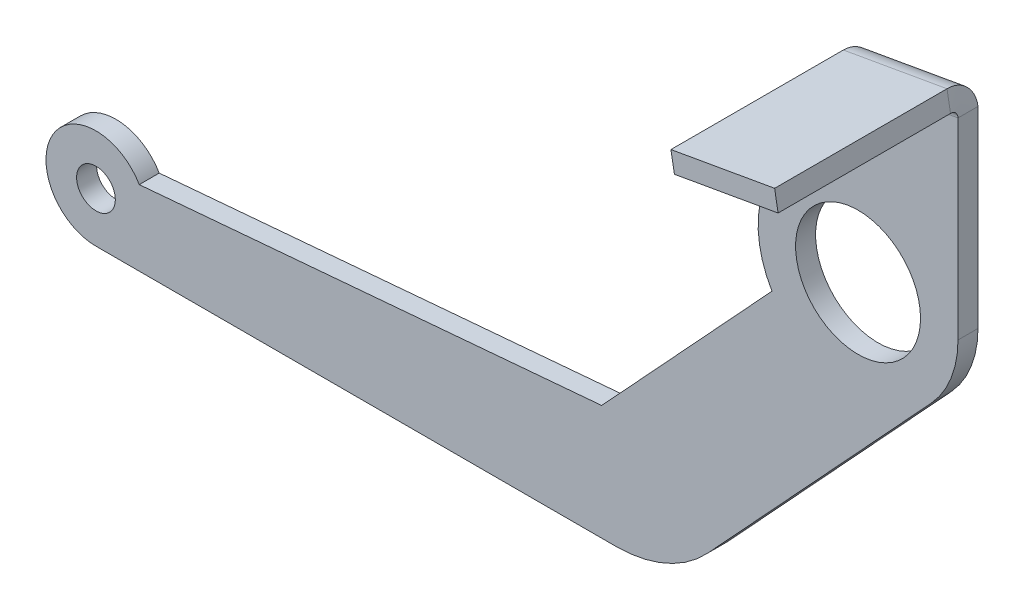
ISO-10303-21;
HEADER;
FILE_DESCRIPTION(('STEP AP214'),'2;1');
FILE_NAME('part.step','',(''),(''),'','','');
FILE_SCHEMA(('AUTOMOTIVE_DESIGN { 1 0 10303 214 1 1 1 1 }'));
ENDSEC;
DATA;
#1=APPLICATION_CONTEXT('core data for automotive mechanical design processes');
#2=APPLICATION_PROTOCOL_DEFINITION('international standard','automotive_design',2000,#1);
#3=PRODUCT_CONTEXT('',#1,'mechanical');
#4=PRODUCT('Part','Part','',(#3));
#5=PRODUCT_RELATED_PRODUCT_CATEGORY('part','',(#4));
#6=PRODUCT_DEFINITION_FORMATION('','',#4);
#7=PRODUCT_DEFINITION_CONTEXT('part definition',#1,'design');
#8=PRODUCT_DEFINITION('design','',#6,#7);
#9=PRODUCT_DEFINITION_SHAPE('','',#8);
#10=(LENGTH_UNIT() NAMED_UNIT(*) SI_UNIT(.MILLI.,.METRE.));
#11=(NAMED_UNIT(*) PLANE_ANGLE_UNIT() SI_UNIT($,.RADIAN.));
#12=(NAMED_UNIT(*) SI_UNIT($,.STERADIAN.) SOLID_ANGLE_UNIT());
#13=UNCERTAINTY_MEASURE_WITH_UNIT(LENGTH_MEASURE(1.E-05),#10,'distance_accuracy_value','');
#14=(GEOMETRIC_REPRESENTATION_CONTEXT(3) GLOBAL_UNCERTAINTY_ASSIGNED_CONTEXT((#13)) GLOBAL_UNIT_ASSIGNED_CONTEXT((#10,
#11,#12)) REPRESENTATION_CONTEXT('',''));
#15=CARTESIAN_POINT('',(0.,0.,0.));
#16=DIRECTION('',(0.,0.,1.));
#17=DIRECTION('',(1.,0.,0.));
#18=AXIS2_PLACEMENT_3D('',#15,#16,#17);
#19=CARTESIAN_POINT('',(60.7,0.,1.6));
#20=DIRECTION('',(1.,0.,0.));
#21=DIRECTION('',(0.,1.,0.));
#22=AXIS2_PLACEMENT_3D('',#19,#20,#21);
#23=PLANE('',#22);
#24=DIRECTION('',(0.,1.,0.));
#25=VECTOR('',#24,1.);
#26=CARTESIAN_POINT('',(60.7,0.,1.6));
#27=LINE('',#26,#25);
#28=CARTESIAN_POINT('',(60.7,31.9943730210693,1.6));
#29=VERTEX_POINT('',#28);
#30=CARTESIAN_POINT('',(60.7,37.1148888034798,1.6));
#31=VERTEX_POINT('',#30);
#32=EDGE_CURVE('E363',#29,#31,#27,.T.);
#33=ORIENTED_EDGE('',*,*,#32,.T.);
#34=DIRECTION('',(0.,0.,1.));
#35=VECTOR('',#34,1.);
#36=CARTESIAN_POINT('',(60.7,37.1148888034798,1.60000000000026));
#37=LINE('',#36,#35);
#38=CARTESIAN_POINT('',(60.7,37.1148888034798,0.));
#39=VERTEX_POINT('',#38);
#40=EDGE_CURVE('E408',#31,#39,#37,.F.);
#41=ORIENTED_EDGE('',*,*,#40,.T.);
#42=DIRECTION('',(0.,1.,0.));
#43=VECTOR('',#42,1.);
#44=CARTESIAN_POINT('',(60.7,0.,0.));
#45=LINE('',#44,#43);
#46=CARTESIAN_POINT('',(60.7,31.9943730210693,0.));
#47=VERTEX_POINT('',#46);
#48=EDGE_CURVE('E374',#47,#39,#45,.T.);
#49=ORIENTED_EDGE('',*,*,#48,.F.);
#50=DIRECTION('',(0.,0.,1.));
#51=VECTOR('',#50,1.);
#52=CARTESIAN_POINT('',(60.7,31.9943730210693,1.6));
#53=LINE('',#52,#51);
#54=EDGE_CURVE('E323',#47,#29,#53,.T.);
#55=ORIENTED_EDGE('',*,*,#54,.T.);
#56=EDGE_LOOP('',(#33,#41,#49,#55));
#57=FACE_BOUND('',#56,.T.);
#58=ADVANCED_FACE('F39',(#57),#23,.F.);
#59=CARTESIAN_POINT('',(0.,0.,1.6));
#60=DIRECTION('',(0.,0.,1.));
#61=DIRECTION('',(1.,0.,0.));
#62=AXIS2_PLACEMENT_3D('',#59,#60,#61);
#63=PLANE('',#62);
#64=CARTESIAN_POINT('',(61.,24.,1.6));
#65=DIRECTION('',(0.,0.,1.));
#66=DIRECTION('',(1.,0.,0.));
#67=AXIS2_PLACEMENT_3D('',#64,#65,#66);
#68=CIRCLE('',#67,5.);
#69=CARTESIAN_POINT('',(66.,24.,1.6));
#70=VERTEX_POINT('',#69);
#71=EDGE_CURVE('E415',#70,#70,#68,.T.);
#72=ORIENTED_EDGE('',*,*,#71,.F.);
#73=EDGE_LOOP('',(#72));
#74=FACE_BOUND('',#73,.T.);
#75=CARTESIAN_POINT('',(0.,0.,1.6));
#76=DIRECTION('',(0.,0.,1.));
#77=DIRECTION('',(1.,0.,0.));
#78=AXIS2_PLACEMENT_3D('',#75,#76,#77);
#79=CIRCLE('',#78,1.55);
#80=CARTESIAN_POINT('',(1.55,0.,1.6));
#81=VERTEX_POINT('',#80);
#82=EDGE_CURVE('E419',#81,#81,#79,.T.);
#83=ORIENTED_EDGE('',*,*,#82,.F.);
#84=EDGE_LOOP('',(#83));
#85=FACE_BOUND('',#84,.T.);
#86=DIRECTION('',(1.,0.,0.));
#87=VECTOR('',#86,1.);
#88=CARTESIAN_POINT('',(0.,-4.00000000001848,1.6));
#89=LINE('',#88,#87);
#90=CARTESIAN_POINT('',(0.,-4.00000000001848,1.6));
#91=VERTEX_POINT('',#90);
#92=CARTESIAN_POINT('',(41.6275410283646,-4.00000000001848,1.6));
#93=VERTEX_POINT('',#92);
#94=EDGE_CURVE('E344',#91,#93,#89,.T.);
#95=ORIENTED_EDGE('',*,*,#94,.T.);
#96=CARTESIAN_POINT('',(41.6275410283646,5.99999999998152,1.6));
#97=DIRECTION('',(0.,0.,1.));
#98=DIRECTION('',(1.,0.,0.));
#99=AXIS2_PLACEMENT_3D('',#96,#97,#98);
#100=CIRCLE('',#99,10.);
#101=CARTESIAN_POINT('',(48.9689073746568,-0.790017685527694,1.6));
#102=VERTEX_POINT('',#101);
#103=EDGE_CURVE('E61',#93,#102,#100,.T.);
#104=ORIENTED_EDGE('',*,*,#103,.T.);
#105=DIRECTION('',(0.679001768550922,0.734136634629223,0.));
#106=VECTOR('',#105,1.);
#107=CARTESIAN_POINT('',(26.7859238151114,-24.7742569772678,1.6));
#108=LINE('',#107,#106);
#109=CARTESIAN_POINT('',(66.8730930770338,18.5679858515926,1.6));
#110=VERTEX_POINT('',#109);
#111=EDGE_CURVE('E349',#102,#110,#108,.T.);
#112=ORIENTED_EDGE('',*,*,#111,.T.);
#113=CARTESIAN_POINT('',(61.,24.,1.6));
#114=DIRECTION('',(0.,0.,1.));
#115=DIRECTION('',(1.,0.,0.));
#116=AXIS2_PLACEMENT_3D('',#113,#114,#115);
#117=CIRCLE('',#116,8.);
#118=CARTESIAN_POINT('',(69.,24.,1.6));
#119=VERTEX_POINT('',#118);
#120=EDGE_CURVE('E351',#110,#119,#117,.T.);
#121=ORIENTED_EDGE('',*,*,#120,.T.);
#122=DIRECTION('',(0.,1.,0.));
#123=VECTOR('',#122,1.);
#124=CARTESIAN_POINT('',(69.,0.,1.6));
#125=LINE('',#124,#123);
#126=CARTESIAN_POINT('',(69.,39.3907440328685,1.6));
#127=VERTEX_POINT('',#126);
#128=EDGE_CURVE('E359',#119,#127,#125,.T.);
#129=ORIENTED_EDGE('',*,*,#128,.T.);
#130=DIRECTION('',(-0.98480775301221,-0.173648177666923,0.));
#131=VECTOR('',#130,1.);
#132=CARTESIAN_POINT('',(60.8041889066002,37.9456014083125,1.59999999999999));
#133=LINE('',#132,#131);
#134=CARTESIAN_POINT('',(60.8041889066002,37.9456014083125,1.6));
#135=VERTEX_POINT('',#134);
#136=EDGE_CURVE('E208',#135,#127,#133,.F.);
#137=ORIENTED_EDGE('',*,*,#136,.F.);
#138=DIRECTION('',(-0.173648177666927,0.984807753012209,0.));
#139=VECTOR('',#138,1.);
#140=CARTESIAN_POINT('',(60.9431074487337,37.1577552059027,1.59999999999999));
#141=LINE('',#140,#139);
#142=CARTESIAN_POINT('',(60.9431074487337,37.1577552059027,1.6));
#143=VERTEX_POINT('',#142);
#144=EDGE_CURVE('E409',#143,#135,#141,.T.);
#145=ORIENTED_EDGE('',*,*,#144,.F.);
#146=DIRECTION('',(0.984807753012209,0.173648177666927,0.));
#147=VECTOR('',#146,1.);
#148=CARTESIAN_POINT('',(60.1552612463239,37.0188366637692,1.59999999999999));
#149=LINE('',#148,#147);
#150=EDGE_CURVE('E405',#31,#143,#149,.T.);
#151=ORIENTED_EDGE('',*,*,#150,.F.);
#152=ORIENTED_EDGE('',*,*,#32,.F.);
#153=CARTESIAN_POINT('',(54.1088077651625,19.9365692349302,1.6));
#154=VERTEX_POINT('',#153);
#155=EDGE_CURVE('E360',#29,#154,#117,.T.);
#156=ORIENTED_EDGE('',*,*,#155,.T.);
#157=DIRECTION('',(0.679001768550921,0.734136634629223,0.));
#158=VECTOR('',#157,1.);
#159=CARTESIAN_POINT('',(19.2243164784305,-17.7805387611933,1.6));
#160=LINE('',#159,#158);
#161=CARTESIAN_POINT('',(40.4789790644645,5.19999999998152,1.6));
#162=VERTEX_POINT('',#161);
#163=EDGE_CURVE('E333',#162,#154,#160,.T.);
#164=ORIENTED_EDGE('',*,*,#163,.F.);
#165=DIRECTION('',(-0.996283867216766,-0.0861304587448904,0.));
#166=VECTOR('',#165,1.);
#167=CARTESIAN_POINT('',(-0.145922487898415,1.68790718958,1.6));
#168=LINE('',#167,#166);
#169=CARTESIAN_POINT('',(3.46410161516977,1.99999999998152,1.6));
#170=VERTEX_POINT('',#169);
#171=EDGE_CURVE('E353',#162,#170,#168,.T.);
#172=ORIENTED_EDGE('',*,*,#171,.T.);
#173=CARTESIAN_POINT('',(0.,0.,1.6));
#174=DIRECTION('',(0.,0.,1.));
#175=DIRECTION('',(1.,0.,0.));
#176=AXIS2_PLACEMENT_3D('',#173,#174,#175);
#177=CIRCLE('',#176,4.00000000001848);
#178=EDGE_CURVE('E348',#170,#91,#177,.T.);
#179=ORIENTED_EDGE('',*,*,#178,.T.);
#180=EDGE_LOOP('',(#95,#104,#112,#121,#129,#137,#145,#151,#152,#156,#164,#172,#179));
#181=FACE_BOUND('',#180,.T.);
#182=ADVANCED_FACE('F260',(#74,#85,#181),#63,.T.);
#183=CARTESIAN_POINT('',(0.,0.,0.));
#184=DIRECTION('',(0.,0.,1.));
#185=DIRECTION('',(1.,0.,0.));
#186=AXIS2_PLACEMENT_3D('',#183,#184,#185);
#187=PLANE('',#186);
#188=CARTESIAN_POINT('',(0.,0.,0.));
#189=DIRECTION('',(0.,0.,1.));
#190=DIRECTION('',(1.,0.,0.));
#191=AXIS2_PLACEMENT_3D('',#188,#189,#190);
#192=CIRCLE('',#191,1.55);
#193=CARTESIAN_POINT('',(1.55,0.,0.));
#194=VERTEX_POINT('',#193);
#195=EDGE_CURVE('E315',#194,#194,#192,.T.);
#196=ORIENTED_EDGE('',*,*,#195,.T.);
#197=EDGE_LOOP('',(#196));
#198=FACE_BOUND('',#197,.T.);
#199=CARTESIAN_POINT('',(61.,24.,0.));
#200=DIRECTION('',(0.,0.,1.));
#201=DIRECTION('',(1.,0.,0.));
#202=AXIS2_PLACEMENT_3D('',#199,#200,#201);
#203=CIRCLE('',#202,5.);
#204=CARTESIAN_POINT('',(66.,24.,0.));
#205=VERTEX_POINT('',#204);
#206=EDGE_CURVE('E416',#205,#205,#203,.T.);
#207=ORIENTED_EDGE('',*,*,#206,.T.);
#208=EDGE_LOOP('',(#207));
#209=FACE_BOUND('',#208,.T.);
#210=DIRECTION('',(0.679001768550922,0.734136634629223,0.));
#211=VECTOR('',#210,1.);
#212=CARTESIAN_POINT('',(26.7859238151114,-24.7742569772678,0.));
#213=LINE('',#212,#211);
#214=CARTESIAN_POINT('',(48.9689073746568,-0.790017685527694,0.));
#215=VERTEX_POINT('',#214);
#216=CARTESIAN_POINT('',(66.8730930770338,18.5679858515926,0.));
#217=VERTEX_POINT('',#216);
#218=EDGE_CURVE('E313',#215,#217,#213,.T.);
#219=ORIENTED_EDGE('',*,*,#218,.F.);
#220=CARTESIAN_POINT('',(41.6275410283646,5.99999999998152,0.));
#221=DIRECTION('',(0.,0.,1.));
#222=DIRECTION('',(1.,0.,0.));
#223=AXIS2_PLACEMENT_3D('',#220,#221,#222);
#224=CIRCLE('',#223,10.);
#225=CARTESIAN_POINT('',(41.6275410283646,-4.00000000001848,0.));
#226=VERTEX_POINT('',#225);
#227=EDGE_CURVE('E11',#215,#226,#224,.F.);
#228=ORIENTED_EDGE('',*,*,#227,.T.);
#229=DIRECTION('',(1.,0.,0.));
#230=VECTOR('',#229,1.);
#231=CARTESIAN_POINT('',(0.,-4.00000000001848,0.));
#232=LINE('',#231,#230);
#233=CARTESIAN_POINT('',(0.,-4.00000000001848,0.));
#234=VERTEX_POINT('',#233);
#235=EDGE_CURVE('E309',#234,#226,#232,.T.);
#236=ORIENTED_EDGE('',*,*,#235,.F.);
#237=CARTESIAN_POINT('',(0.,0.,0.));
#238=DIRECTION('',(0.,0.,1.));
#239=DIRECTION('',(1.,0.,0.));
#240=AXIS2_PLACEMENT_3D('',#237,#238,#239);
#241=CIRCLE('',#240,4.00000000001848);
#242=CARTESIAN_POINT('',(3.46410161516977,1.99999999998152,0.));
#243=VERTEX_POINT('',#242);
#244=EDGE_CURVE('E300',#243,#234,#241,.T.);
#245=ORIENTED_EDGE('',*,*,#244,.F.);
#246=DIRECTION('',(-0.996283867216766,-0.0861304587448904,0.));
#247=VECTOR('',#246,1.);
#248=CARTESIAN_POINT('',(-0.145922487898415,1.68790718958,0.));
#249=LINE('',#248,#247);
#250=CARTESIAN_POINT('',(40.4789790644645,5.19999999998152,0.));
#251=VERTEX_POINT('',#250);
#252=EDGE_CURVE('E310',#251,#243,#249,.T.);
#253=ORIENTED_EDGE('',*,*,#252,.F.);
#254=DIRECTION('',(0.679001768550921,0.734136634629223,0.));
#255=VECTOR('',#254,1.);
#256=CARTESIAN_POINT('',(19.2243164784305,-17.7805387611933,0.));
#257=LINE('',#256,#255);
#258=CARTESIAN_POINT('',(54.1088077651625,19.9365692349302,0.));
#259=VERTEX_POINT('',#258);
#260=EDGE_CURVE('E368',#251,#259,#257,.T.);
#261=ORIENTED_EDGE('',*,*,#260,.T.);
#262=CARTESIAN_POINT('',(61.,24.,0.));
#263=DIRECTION('',(0.,0.,1.));
#264=DIRECTION('',(1.,0.,0.));
#265=AXIS2_PLACEMENT_3D('',#262,#263,#264);
#266=CIRCLE('',#265,8.);
#267=EDGE_CURVE('E371',#47,#259,#266,.T.);
#268=ORIENTED_EDGE('',*,*,#267,.F.);
#269=ORIENTED_EDGE('',*,*,#48,.T.);
#270=DIRECTION('',(-0.984807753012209,-0.173648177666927,0.));
#271=VECTOR('',#270,1.);
#272=CARTESIAN_POINT('',(-4.51669083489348,25.6154266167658,0.));
#273=LINE('',#272,#271);
#274=CARTESIAN_POINT('',(60.9431074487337,37.1577552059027,0.));
#275=VERTEX_POINT('',#274);
#276=EDGE_CURVE('E336',#275,#39,#273,.T.);
#277=ORIENTED_EDGE('',*,*,#276,.F.);
#278=DIRECTION('',(0.173648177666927,-0.984807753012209,0.));
#279=VECTOR('',#278,1.);
#280=CARTESIAN_POINT('',(65.4597982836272,11.5423285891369,0.));
#281=LINE('',#280,#279);
#282=CARTESIAN_POINT('',(60.8041889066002,37.9456014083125,0.));
#283=VERTEX_POINT('',#282);
#284=EDGE_CURVE('E331',#283,#275,#281,.T.);
#285=ORIENTED_EDGE('',*,*,#284,.F.);
#286=DIRECTION('',(-0.98480775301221,-0.173648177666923,0.));
#287=VECTOR('',#286,1.);
#288=CARTESIAN_POINT('',(60.8041889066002,37.9456014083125,0.));
#289=LINE('',#288,#287);
#290=CARTESIAN_POINT('',(69.,39.3907440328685,0.));
#291=VERTEX_POINT('',#290);
#292=EDGE_CURVE('E163',#283,#291,#289,.F.);
#293=ORIENTED_EDGE('',*,*,#292,.T.);
#294=DIRECTION('',(0.,1.,0.));
#295=VECTOR('',#294,1.);
#296=CARTESIAN_POINT('',(69.,0.,0.));
#297=LINE('',#296,#295);
#298=CARTESIAN_POINT('',(69.,24.,0.));
#299=VERTEX_POINT('',#298);
#300=EDGE_CURVE('E377',#299,#291,#297,.T.);
#301=ORIENTED_EDGE('',*,*,#300,.F.);
#302=CARTESIAN_POINT('',(61.,24.,0.));
#303=DIRECTION('',(0.,0.,1.));
#304=DIRECTION('',(1.,0.,0.));
#305=AXIS2_PLACEMENT_3D('',#302,#303,#304);
#306=CIRCLE('',#305,8.);
#307=EDGE_CURVE('E380',#217,#299,#306,.T.);
#308=ORIENTED_EDGE('',*,*,#307,.F.);
#309=EDGE_LOOP('',(#219,#228,#236,#245,#253,#261,#268,#269,#277,#285,#293,#301,#308));
#310=FACE_BOUND('',#309,.T.);
#311=ADVANCED_FACE('F263',(#198,#209,#310),#187,.F.);
#312=CARTESIAN_POINT('',(0.,-4.00000000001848,1.6));
#313=DIRECTION('',(0.,-1.,0.));
#314=DIRECTION('',(1.,0.,0.));
#315=AXIS2_PLACEMENT_3D('',#312,#313,#314);
#316=PLANE('',#315);
#317=ORIENTED_EDGE('',*,*,#235,.T.);
#318=DIRECTION('',(0.,0.,1.));
#319=VECTOR('',#318,1.);
#320=CARTESIAN_POINT('',(41.6275410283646,-4.00000000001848,1.6));
#321=LINE('',#320,#319);
#322=EDGE_CURVE('E339',#226,#93,#321,.T.);
#323=ORIENTED_EDGE('',*,*,#322,.T.);
#324=ORIENTED_EDGE('',*,*,#94,.F.);
#325=DIRECTION('',(0.,0.,1.));
#326=VECTOR('',#325,1.);
#327=CARTESIAN_POINT('',(0.,-4.00000000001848,1.6));
#328=LINE('',#327,#326);
#329=EDGE_CURVE('E302',#234,#91,#328,.T.);
#330=ORIENTED_EDGE('',*,*,#329,.F.);
#331=EDGE_LOOP('',(#317,#323,#324,#330));
#332=FACE_BOUND('',#331,.T.);
#333=ADVANCED_FACE('F267',(#332),#316,.T.);
#334=CARTESIAN_POINT('',(26.7859238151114,-24.7742569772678,1.6));
#335=DIRECTION('',(0.734136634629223,-0.679001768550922,0.));
#336=DIRECTION('',(0.679001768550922,0.734136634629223,0.));
#337=AXIS2_PLACEMENT_3D('',#334,#335,#336);
#338=PLANE('',#337);
#339=ORIENTED_EDGE('',*,*,#111,.F.);
#340=DIRECTION('',(0.,0.,1.));
#341=VECTOR('',#340,1.);
#342=CARTESIAN_POINT('',(48.9689073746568,-0.790017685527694,1.6));
#343=LINE('',#342,#341);
#344=EDGE_CURVE('E47',#102,#215,#343,.F.);
#345=ORIENTED_EDGE('',*,*,#344,.T.);
#346=ORIENTED_EDGE('',*,*,#218,.T.);
#347=DIRECTION('',(0.,0.,1.));
#348=VECTOR('',#347,1.);
#349=CARTESIAN_POINT('',(66.8730930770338,18.5679858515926,1.6));
#350=LINE('',#349,#348);
#351=EDGE_CURVE('E327',#217,#110,#350,.T.);
#352=ORIENTED_EDGE('',*,*,#351,.T.);
#353=EDGE_LOOP('',(#339,#345,#346,#352));
#354=FACE_BOUND('',#353,.T.);
#355=ADVANCED_FACE('F289',(#354),#338,.T.);
#356=CARTESIAN_POINT('',(61.,24.,1.6));
#357=DIRECTION('',(0.,0.,1.));
#358=DIRECTION('',(1.,0.,0.));
#359=AXIS2_PLACEMENT_3D('',#356,#357,#358);
#360=CYLINDRICAL_SURFACE('',#359,8.);
#361=ORIENTED_EDGE('',*,*,#351,.F.);
#362=ORIENTED_EDGE('',*,*,#307,.T.);
#363=DIRECTION('',(0.,0.,1.));
#364=VECTOR('',#363,1.);
#365=CARTESIAN_POINT('',(69.,24.,1.6));
#366=LINE('',#365,#364);
#367=EDGE_CURVE('E325',#299,#119,#366,.T.);
#368=ORIENTED_EDGE('',*,*,#367,.T.);
#369=ORIENTED_EDGE('',*,*,#120,.F.);
#370=EDGE_LOOP('',(#361,#362,#368,#369));
#371=FACE_BOUND('',#370,.T.);
#372=ADVANCED_FACE('F282',(#371),#360,.T.);
#373=CARTESIAN_POINT('',(69.,0.,1.6));
#374=DIRECTION('',(1.,0.,0.));
#375=DIRECTION('',(0.,1.,0.));
#376=AXIS2_PLACEMENT_3D('',#373,#374,#375);
#377=PLANE('',#376);
#378=DIRECTION('',(0.,0.,-1.));
#379=VECTOR('',#378,1.);
#380=CARTESIAN_POINT('',(69.,39.3907440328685,1.59999999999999));
#381=LINE('',#380,#379);
#382=EDGE_CURVE('E390',#127,#291,#381,.T.);
#383=ORIENTED_EDGE('',*,*,#382,.F.);
#384=ORIENTED_EDGE('',*,*,#128,.F.);
#385=ORIENTED_EDGE('',*,*,#367,.F.);
#386=ORIENTED_EDGE('',*,*,#300,.T.);
#387=EDGE_LOOP('',(#383,#384,#385,#386));
#388=FACE_BOUND('',#387,.T.);
#389=ADVANCED_FACE('F280',(#388),#377,.T.);
#390=ORIENTED_EDGE('',*,*,#54,.F.);
#391=ORIENTED_EDGE('',*,*,#267,.T.);
#392=DIRECTION('',(0.,0.,1.));
#393=VECTOR('',#392,1.);
#394=CARTESIAN_POINT('',(54.1088077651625,19.9365692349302,1.6));
#395=LINE('',#394,#393);
#396=EDGE_CURVE('E321',#259,#154,#395,.T.);
#397=ORIENTED_EDGE('',*,*,#396,.T.);
#398=ORIENTED_EDGE('',*,*,#155,.F.);
#399=EDGE_LOOP('',(#390,#391,#397,#398));
#400=FACE_BOUND('',#399,.T.);
#401=ADVANCED_FACE('F276',(#400),#360,.T.);
#402=CARTESIAN_POINT('',(19.2243164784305,-17.7805387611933,1.6));
#403=DIRECTION('',(0.734136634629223,-0.679001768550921,0.));
#404=DIRECTION('',(0.679001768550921,0.734136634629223,0.));
#405=AXIS2_PLACEMENT_3D('',#402,#403,#404);
#406=PLANE('',#405);
#407=ORIENTED_EDGE('',*,*,#396,.F.);
#408=ORIENTED_EDGE('',*,*,#260,.F.);
#409=DIRECTION('',(0.,0.,1.));
#410=VECTOR('',#409,1.);
#411=CARTESIAN_POINT('',(40.4789790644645,5.19999999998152,1.6));
#412=LINE('',#411,#410);
#413=EDGE_CURVE('E319',#251,#162,#412,.T.);
#414=ORIENTED_EDGE('',*,*,#413,.T.);
#415=ORIENTED_EDGE('',*,*,#163,.T.);
#416=EDGE_LOOP('',(#407,#408,#414,#415));
#417=FACE_BOUND('',#416,.T.);
#418=ADVANCED_FACE('F272',(#417),#406,.F.);
#419=CARTESIAN_POINT('',(-0.145922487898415,1.68790718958,1.6));
#420=DIRECTION('',(-0.0861304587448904,0.996283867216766,0.));
#421=DIRECTION('',(-0.996283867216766,-0.0861304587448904,0.));
#422=AXIS2_PLACEMENT_3D('',#419,#420,#421);
#423=PLANE('',#422);
#424=ORIENTED_EDGE('',*,*,#413,.F.);
#425=ORIENTED_EDGE('',*,*,#252,.T.);
#426=DIRECTION('',(0.,0.,1.));
#427=VECTOR('',#426,1.);
#428=CARTESIAN_POINT('',(3.46410161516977,1.99999999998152,1.6));
#429=LINE('',#428,#427);
#430=EDGE_CURVE('E304',#243,#170,#429,.T.);
#431=ORIENTED_EDGE('',*,*,#430,.T.);
#432=ORIENTED_EDGE('',*,*,#171,.F.);
#433=EDGE_LOOP('',(#424,#425,#431,#432));
#434=FACE_BOUND('',#433,.T.);
#435=ADVANCED_FACE('F269',(#434),#423,.T.);
#436=CARTESIAN_POINT('',(0.,0.,1.6));
#437=DIRECTION('',(0.,0.,1.));
#438=DIRECTION('',(1.,0.,0.));
#439=AXIS2_PLACEMENT_3D('',#436,#437,#438);
#440=CYLINDRICAL_SURFACE('',#439,4.00000000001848);
#441=ORIENTED_EDGE('',*,*,#244,.T.);
#442=ORIENTED_EDGE('',*,*,#329,.T.);
#443=ORIENTED_EDGE('',*,*,#178,.F.);
#444=ORIENTED_EDGE('',*,*,#430,.F.);
#445=EDGE_LOOP('',(#441,#442,#443,#444));
#446=FACE_BOUND('',#445,.T.);
#447=ADVANCED_FACE('F258',(#446),#440,.T.);
#448=CARTESIAN_POINT('',(0.,0.,1.6));
#449=DIRECTION('',(0.,0.,1.));
#450=DIRECTION('',(1.,0.,0.));
#451=AXIS2_PLACEMENT_3D('',#448,#449,#450);
#452=CYLINDRICAL_SURFACE('',#451,1.55);
#453=ORIENTED_EDGE('',*,*,#82,.T.);
#454=EDGE_LOOP('',(#453));
#455=FACE_BOUND('',#454,.T.);
#456=ORIENTED_EDGE('',*,*,#195,.F.);
#457=EDGE_LOOP('',(#456));
#458=FACE_BOUND('',#457,.T.);
#459=ADVANCED_FACE('F254',(#455,#458),#452,.F.);
#460=CARTESIAN_POINT('',(61.,24.,0.));
#461=DIRECTION('',(0.,0.,1.));
#462=DIRECTION('',(1.,0.,0.));
#463=AXIS2_PLACEMENT_3D('',#460,#461,#462);
#464=CYLINDRICAL_SURFACE('',#463,5.);
#465=ORIENTED_EDGE('',*,*,#206,.F.);
#466=EDGE_LOOP('',(#465));
#467=FACE_BOUND('',#466,.T.);
#468=ORIENTED_EDGE('',*,*,#71,.T.);
#469=EDGE_LOOP('',(#468));
#470=FACE_BOUND('',#469,.T.);
#471=ADVANCED_FACE('F247',(#467,#470),#464,.F.);
#472=CARTESIAN_POINT('',(60.9431074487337,37.1577552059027,1.59999999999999));
#473=DIRECTION('',(-0.984807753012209,-0.173648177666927,0.));
#474=DIRECTION('',(0.173648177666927,-0.984807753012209,0.));
#475=AXIS2_PLACEMENT_3D('',#472,#473,#474);
#476=PLANE('',#475);
#477=DIRECTION('',(0.,0.,-1.));
#478=VECTOR('',#477,1.);
#479=CARTESIAN_POINT('',(60.8041889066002,37.9456014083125,1.59999999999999));
#480=LINE('',#479,#478);
#481=EDGE_CURVE('E395',#135,#283,#480,.T.);
#482=ORIENTED_EDGE('',*,*,#481,.T.);
#483=ORIENTED_EDGE('',*,*,#284,.T.);
#484=DIRECTION('',(0.,0.,-1.));
#485=VECTOR('',#484,1.);
#486=CARTESIAN_POINT('',(60.9431074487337,37.1577552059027,1.59999999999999));
#487=LINE('',#486,#485);
#488=EDGE_CURVE('E394',#143,#275,#487,.T.);
#489=ORIENTED_EDGE('',*,*,#488,.F.);
#490=ORIENTED_EDGE('',*,*,#144,.T.);
#491=EDGE_LOOP('',(#482,#483,#489,#490));
#492=FACE_BOUND('',#491,.T.);
#493=ADVANCED_FACE('F244',(#492),#476,.T.);
#494=CARTESIAN_POINT('',(60.1552612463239,37.0188366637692,1.59999999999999));
#495=DIRECTION('',(-0.173648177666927,0.984807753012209,0.));
#496=DIRECTION('',(-0.984807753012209,-0.173648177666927,0.));
#497=AXIS2_PLACEMENT_3D('',#494,#495,#496);
#498=PLANE('',#497);
#499=ORIENTED_EDGE('',*,*,#40,.F.);
#500=ORIENTED_EDGE('',*,*,#150,.T.);
#501=ORIENTED_EDGE('',*,*,#488,.T.);
#502=ORIENTED_EDGE('',*,*,#276,.T.);
#503=EDGE_LOOP('',(#499,#500,#501,#502));
#504=FACE_BOUND('',#503,.T.);
#505=ADVANCED_FACE('F235',(#504),#498,.T.);
#506=CARTESIAN_POINT('',(69.,39.3907440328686,-0.0160000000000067));
#507=CARTESIAN_POINT('',(68.9583041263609,39.6779935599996,-0.0160000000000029));
#508=CARTESIAN_POINT('',(68.9166430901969,39.965027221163,0.041676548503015));
#509=CARTESIAN_POINT('',(68.8409348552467,40.4959326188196,0.263689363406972));
#510=CARTESIAN_POINT('',(68.8069317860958,40.7395449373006,0.42793827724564));
#511=CARTESIAN_POINT('',(68.7530615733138,41.146600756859,0.838164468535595));
#512=CARTESIAN_POINT('',(68.7332224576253,41.3098853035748,1.08398033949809));
#513=CARTESIAN_POINT('',(68.7120351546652,41.5315871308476,1.61996668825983));
#514=CARTESIAN_POINT('',(68.7107005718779,41.5899181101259,1.9098740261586));
#515=CARTESIAN_POINT('',(68.7193845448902,41.5914493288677,2.2));
#516=CARTESIAN_POINT('',(69.,39.3907440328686,0.));
#517=CARTESIAN_POINT('',(68.9586678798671,39.6759306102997,0.));
#518=CARTESIAN_POINT('',(68.9173703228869,39.9609028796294,0.057260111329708));
#519=CARTESIAN_POINT('',(68.8423340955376,40.4879971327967,0.27766994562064));
#520=CARTESIAN_POINT('',(68.8086392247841,40.7298615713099,0.440732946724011));
#521=CARTESIAN_POINT('',(68.7552833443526,41.1340004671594,0.847997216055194));
#522=CARTESIAN_POINT('',(68.7356501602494,41.2961171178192,1.09203824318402));
#523=CARTESIAN_POINT('',(68.7147412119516,41.5162403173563,1.62415465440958));
#524=CARTESIAN_POINT('',(68.7134789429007,41.5741611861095,1.91196880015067));
#525=CARTESIAN_POINT('',(68.7221629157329,41.5756924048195,2.2));
#526=CARTESIAN_POINT('',(69.,39.3907440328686,1.59999999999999));
#527=CARTESIAN_POINT('',(68.9950432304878,39.4696356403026,1.59999999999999));
#528=CARTESIAN_POINT('',(68.9900935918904,39.5484687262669,1.61561639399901));
#529=CARTESIAN_POINT('',(68.9822581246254,39.6944485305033,1.67572816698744));
#530=CARTESIAN_POINT('',(68.9793830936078,39.7615249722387,1.72019989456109));
#531=CARTESIAN_POINT('',(68.9774604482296,39.8739714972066,1.83127196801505));
#532=CARTESIAN_POINT('',(68.978420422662,39.9192985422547,1.89782861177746));
#533=CARTESIAN_POINT('',(68.9853469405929,39.9815589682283,2.04295126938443));
#534=CARTESIAN_POINT('',(68.9913160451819,39.9984687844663,2.12144619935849));
#535=CARTESIAN_POINT('',(69.,40.,2.2));
#536=CARTESIAN_POINT('',(69.,39.3907440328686,1.61615999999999));
#537=CARTESIAN_POINT('',(68.9954106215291,39.4675520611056,1.61615999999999));
#538=CARTESIAN_POINT('',(68.9908280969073,39.5443031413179,1.63135579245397));
#539=CARTESIAN_POINT('',(68.9836713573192,39.6864336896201,1.68984855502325));
#540=CARTESIAN_POINT('',(68.9811076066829,39.751744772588,1.73312251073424));
#541=CARTESIAN_POINT('',(68.9797044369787,39.8612452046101,1.84120304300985));
#542=CARTESIAN_POINT('',(68.9808724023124,39.9053926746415,1.90596709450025));
#543=CARTESIAN_POINT('',(68.9880800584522,39.9660586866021,2.04718111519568));
#544=CARTESIAN_POINT('',(68.994122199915,39.9825542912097,2.12356192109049));
#545=CARTESIAN_POINT('',(69.0028061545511,39.9840855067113,2.2));
#546=B_SPLINE_SURFACE_WITH_KNOTS('',1,3,((#506,#507,#508,#509,#510,#511,#512,#513,#514,#515),
(#516,#517,#518,#519,#520,#521,#522,#523,#524,#525),(#526,#527,#528,#529,#530,#531,#532,#533,
#534,#535),(#536,#537,#538,#539,#540,#541,#542,#543,#544,#545)),.UNSPECIFIED.,.F.,.F.,.F.,(2,1,
1,2),(4,2,2,2,4),(-0.01,0.,1.,1.0101),(0.,0.25,0.5,0.75,1.),.UNSPECIFIED.);
#547=DIRECTION('',(-0.173648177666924,0.984807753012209,0.));
#548=VECTOR('',#547,1.);
#549=CARTESIAN_POINT('',(69.,40.,2.2));
#550=LINE('',#549,#548);
#551=CARTESIAN_POINT('',(69.,40.,2.2));
#552=VERTEX_POINT('',#551);
#553=CARTESIAN_POINT('',(68.7221629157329,41.5756924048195,2.2));
#554=VERTEX_POINT('',#553);
#555=EDGE_CURVE('E438',#552,#554,#550,.T.);
#556=CARTESIAN_POINT('',(69.,39.3907440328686,1.59999999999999));
#557=CARTESIAN_POINT('',(68.9993805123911,39.4006037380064,1.59999979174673));
#558=CARTESIAN_POINT('',(68.9987610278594,39.4104634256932,1.6002409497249));
#559=CARTESIAN_POINT('',(68.9975261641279,39.4301595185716,1.60120450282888));
#560=CARTESIAN_POINT('',(68.9969107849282,39.4399959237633,1.60192689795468));
#561=CARTESIAN_POINT('',(68.9956882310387,39.4596222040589,1.60385143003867));
#562=CARTESIAN_POINT('',(68.995081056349,39.4694120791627,1.60505356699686));
#563=CARTESIAN_POINT('',(68.9938789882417,39.4889221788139,1.6079346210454));
#564=CARTESIAN_POINT('',(68.9932840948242,39.4986424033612,1.60961353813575));
#565=CARTESIAN_POINT('',(68.9921106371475,39.5179902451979,1.61344412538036));
#566=CARTESIAN_POINT('',(68.9915320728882,39.5276178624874,1.61559579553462));
#567=CARTESIAN_POINT('',(68.9903952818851,39.546757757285,1.62036670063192));
#568=CARTESIAN_POINT('',(68.9898370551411,39.5562700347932,1.62298593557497));
#569=CARTESIAN_POINT('',(68.9887448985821,39.5751567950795,1.62868566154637));
#570=CARTESIAN_POINT('',(68.9882109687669,39.5845312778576,1.63176615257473));
#571=CARTESIAN_POINT('',(68.9871713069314,39.603120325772,1.63838096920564));
#572=CARTESIAN_POINT('',(68.9866655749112,39.6123348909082,1.6419152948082));
#573=CARTESIAN_POINT('',(68.9856861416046,39.6305823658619,1.64942926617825));
#574=CARTESIAN_POINT('',(68.9852124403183,39.6396152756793,1.65340891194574));
#575=CARTESIAN_POINT('',(68.9843008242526,39.6574781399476,1.66180393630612));
#576=CARTESIAN_POINT('',(68.9838629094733,39.6663080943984,1.66621931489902));
#577=CARTESIAN_POINT('',(68.9830265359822,39.6837442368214,1.67547516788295));
#578=CARTESIAN_POINT('',(68.9826280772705,39.6923504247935,1.68031564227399));
#579=CARTESIAN_POINT('',(68.9818741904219,39.7093187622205,1.69041002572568));
#580=CARTESIAN_POINT('',(68.981518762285,39.7176809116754,1.69566393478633));
#581=CARTESIAN_POINT('',(68.9808544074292,39.7341414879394,1.70657253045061));
#582=CARTESIAN_POINT('',(68.9805454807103,39.7422399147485,1.71222721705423));
#583=CARTESIAN_POINT('',(68.9799774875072,39.7581539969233,1.72392374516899));
#584=CARTESIAN_POINT('',(68.9797184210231,39.765969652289,1.72996558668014));
#585=CARTESIAN_POINT('',(68.979253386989,39.7812998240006,1.74242186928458));
#586=CARTESIAN_POINT('',(68.979047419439,39.7888143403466,1.74883631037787));
#587=CARTESIAN_POINT('',(68.9786916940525,39.8035245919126,1.76202233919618));
#588=CARTESIAN_POINT('',(68.9785419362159,39.8107203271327,1.76879392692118));
#589=CARTESIAN_POINT('',(68.9783016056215,39.8247761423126,1.78267793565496));
#590=CARTESIAN_POINT('',(68.9782110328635,39.8316362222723,1.78979035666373));
#591=CARTESIAN_POINT('',(68.9780919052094,39.8450046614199,1.80433889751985));
#592=CARTESIAN_POINT('',(68.9780633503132,39.8515130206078,1.8117750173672));
#593=CARTESIAN_POINT('',(68.9780709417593,39.8641628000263,1.82695304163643));
#594=CARTESIAN_POINT('',(68.9781070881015,39.8703042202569,1.83469494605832));
#595=CARTESIAN_POINT('',(68.9782466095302,39.8822057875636,1.85046588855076));
#596=CARTESIAN_POINT('',(68.9783499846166,39.8879659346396,1.85849492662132));
#597=CARTESIAN_POINT('',(68.9786263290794,39.8990915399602,1.87482079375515));
#598=CARTESIAN_POINT('',(68.9787992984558,39.9044569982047,1.88311762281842));
#599=CARTESIAN_POINT('',(68.9792170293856,39.9147807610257,1.89995908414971));
#600=CARTESIAN_POINT('',(68.979461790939,39.9197390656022,1.90850371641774));
#601=CARTESIAN_POINT('',(68.9800251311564,39.9292370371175,1.92582019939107));
#602=CARTESIAN_POINT('',(68.9803437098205,39.9337767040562,1.93459205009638));
#603=CARTESIAN_POINT('',(68.9810565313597,39.9424269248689,1.95234183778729));
#604=CARTESIAN_POINT('',(68.9814507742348,39.946537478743,1.96131977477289));
#605=CARTESIAN_POINT('',(68.9823165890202,39.95432003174,1.97946010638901));
#606=CARTESIAN_POINT('',(68.9827881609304,39.9579920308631,1.98862250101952));
#607=CARTESIAN_POINT('',(68.9838101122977,39.9648890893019,2.00710967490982));
#608=CARTESIAN_POINT('',(68.9843604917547,39.9681141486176,2.0164344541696));
#609=CARTESIAN_POINT('',(68.9855413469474,39.9741100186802,2.03522393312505));
#610=CARTESIAN_POINT('',(68.9861718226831,39.9768808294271,2.04468863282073));
#611=CARTESIAN_POINT('',(68.987513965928,39.9819619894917,2.06373515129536));
#612=CARTESIAN_POINT('',(68.9882256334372,39.9842723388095,2.07331697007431));
#613=CARTESIAN_POINT('',(68.9897310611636,39.9884274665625,2.09257464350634));
#614=CARTESIAN_POINT('',(68.9905248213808,39.9902722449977,2.10225049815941));
#615=CARTESIAN_POINT('',(68.9921951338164,39.9934922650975,2.12167293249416));
#616=CARTESIAN_POINT('',(68.9930716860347,39.994867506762,2.13141951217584));
#617=CARTESIAN_POINT('',(68.9949080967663,39.9971455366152,2.15095991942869));
#618=CARTESIAN_POINT('',(68.9958679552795,39.9980483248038,2.16075374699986));
#619=CARTESIAN_POINT('',(68.9978712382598,39.9993799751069,2.18036504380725));
#620=CARTESIAN_POINT('',(68.9989146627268,39.9998088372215,2.19018251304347));
#621=CARTESIAN_POINT('',(69.,40.,2.2));
#622=B_SPLINE_CURVE_WITH_KNOTS('',3,(#556,#557,#558,#559,#560,#561,#562,#563,#564,#565,#566,
#567,#568,#569,#570,#571,#572,#573,#574,#575,#576,#577,#578,#579,#580,#581,#582,#583,#584,#585,
#586,#587,#588,#589,#590,#591,#592,#593,#594,#595,#596,#597,#598,#599,#600,#601,#602,#603,#604,
#605,#606,#607,#608,#609,#610,#611,#612,#613,#614,#615,#616,#617,#618,#619,#620,#621),
.UNSPECIFIED.,.F.,.F.,(4,2,2,2,2,2,2,2,2,2,2,2,2,2,2,2,2,2,2,2,2,2,2,2,2,2,2,2,2,2,2,2,4),(0.,
0.0296344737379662,0.059268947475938,0.0889034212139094,0.118537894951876,0.14817236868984,
0.177806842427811,0.207441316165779,0.23707578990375,0.266710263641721,0.296344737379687,
0.325979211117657,0.355613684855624,0.385248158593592,0.41488263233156,0.444517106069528,
0.474151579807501,0.503786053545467,0.533420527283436,0.563055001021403,0.592689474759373,
0.622323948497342,0.65195842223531,0.681592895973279,0.711227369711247,0.740861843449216,
0.770496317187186,0.800130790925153,0.829765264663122,0.859399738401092,0.88903421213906,
0.918668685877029,0.948303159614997),.UNSPECIFIED.);
#623=EDGE_CURVE('E166',#127,#552,#622,.T.);
#624=CARTESIAN_POINT('',(69.,39.3907440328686,0.));
#625=CARTESIAN_POINT('',(68.9948344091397,39.4263859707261,-7.6359531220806E-07));
#626=CARTESIAN_POINT('',(68.9896688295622,39.4620278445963,0.000883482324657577));
#627=CARTESIAN_POINT('',(68.9793527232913,39.5332262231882,0.0044165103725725));
#628=CARTESIAN_POINT('',(68.974202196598,39.5687827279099,0.00706529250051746));
#629=CARTESIAN_POINT('',(68.9639312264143,39.6397251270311,0.0141219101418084));
#630=CARTESIAN_POINT('',(68.9588107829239,39.6751110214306,0.0185297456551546));
#631=CARTESIAN_POINT('',(68.9486149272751,39.7456274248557,0.0290936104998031));
#632=CARTESIAN_POINT('',(68.9435395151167,39.7807579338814,0.0352496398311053));
#633=CARTESIAN_POINT('',(68.9334485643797,39.850679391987,0.0492951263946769));
#634=CARTESIAN_POINT('',(68.9284330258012,39.885470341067,0.0571845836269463));
#635=CARTESIAN_POINT('',(68.918476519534,39.9546293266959,0.0746779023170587));
#636=CARTESIAN_POINT('',(68.9135355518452,39.9889973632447,0.0842817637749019));
#637=CARTESIAN_POINT('',(68.9037427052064,40.0572281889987,0.105180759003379));
#638=CARTESIAN_POINT('',(68.8988908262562,40.0910909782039,0.116475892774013));
#639=CARTESIAN_POINT('',(68.8892904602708,40.1582301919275,0.140730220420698));
#640=CARTESIAN_POINT('',(68.8845419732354,40.1915066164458,0.153689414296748));
#641=CARTESIAN_POINT('',(68.8751624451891,40.2573933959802,0.181240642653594));
#642=CARTESIAN_POINT('',(68.8705314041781,40.2900037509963,0.19583267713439));
#643=CARTESIAN_POINT('',(68.8614005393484,40.3544802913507,0.226614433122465));
#644=CARTESIAN_POINT('',(68.8569007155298,40.3863464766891,0.242804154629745));
#645=CARTESIAN_POINT('',(68.8480457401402,40.4492583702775,0.276742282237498));
#646=CARTESIAN_POINT('',(68.8436905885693,40.4803040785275,0.294490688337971));
#647=CARTESIAN_POINT('',(68.8351380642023,40.5415006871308,0.33150342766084));
#648=CARTESIAN_POINT('',(68.8309406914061,40.5716515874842,0.350767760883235));
#649=CARTESIAN_POINT('',(68.8227164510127,40.6309864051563,0.390765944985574));
#650=CARTESIAN_POINT('',(68.8186895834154,40.660170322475,0.411499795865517));
#651=CARTESIAN_POINT('',(68.8108186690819,40.7175013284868,0.454387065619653));
#652=CARTESIAN_POINT('',(68.8069746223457,40.7456484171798,0.476540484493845));
#653=CARTESIAN_POINT('',(68.7994812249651,40.8008384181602,0.522213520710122));
#654=CARTESIAN_POINT('',(68.7958318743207,40.8278813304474,0.545733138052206));
#655=CARTESIAN_POINT('',(68.7887392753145,40.8807982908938,0.594081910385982));
#656=CARTESIAN_POINT('',(68.7852960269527,40.9066723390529,0.618911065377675));
#657=CARTESIAN_POINT('',(68.778626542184,40.9571896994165,0.669819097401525));
#658=CARTESIAN_POINT('',(68.7754003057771,40.981833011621,0.695897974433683));
#659=CARTESIAN_POINT('',(68.7691752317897,41.0298299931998,0.749242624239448));
#660=CARTESIAN_POINT('',(68.7661763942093,41.0531836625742,0.776508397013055));
#661=CARTESIAN_POINT('',(68.7604159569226,41.0985455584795,0.832161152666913));
#662=CARTESIAN_POINT('',(68.7576543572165,41.1205537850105,0.860548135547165));
#663=CARTESIAN_POINT('',(68.7523776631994,41.1631722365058,0.918374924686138));
#664=CARTESIAN_POINT('',(68.7498625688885,41.1837824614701,0.947814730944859));
#665=CARTESIAN_POINT('',(68.74508755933,41.2235557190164,1.0076762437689));
#666=CARTESIAN_POINT('',(68.7428276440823,41.2427187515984,1.03809795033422));
#667=CARTESIAN_POINT('',(68.7385710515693,41.2795519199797,1.09984997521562));
#668=CARTESIAN_POINT('',(68.7365743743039,41.297222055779,1.1311802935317));
#669=CARTESIAN_POINT('',(68.7328516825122,41.3310273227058,1.19467406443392));
#670=CARTESIAN_POINT('',(68.7311256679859,41.3471624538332,1.22683751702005));
#671=CARTESIAN_POINT('',(68.7279510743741,41.3778593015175,1.29192007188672));
#672=CARTESIAN_POINT('',(68.7265024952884,41.3924210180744,1.32483917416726));
#673=CARTESIAN_POINT('',(68.7238888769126,41.4199364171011,1.39135372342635));
#674=CARTESIAN_POINT('',(68.7227238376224,41.432890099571,1.42494917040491));
#675=CARTESIAN_POINT('',(68.7206827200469,41.4571586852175,1.49273547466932));
#676=CARTESIAN_POINT('',(68.7198066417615,41.4684735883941,1.52692633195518));
#677=CARTESIAN_POINT('',(68.7183481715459,41.4894378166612,1.59582108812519));
#678=CARTESIAN_POINT('',(68.7177657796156,41.4990871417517,1.63052498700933));
#679=CARTESIAN_POINT('',(68.7168986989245,41.5166974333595,1.70036222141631));
#680=CARTESIAN_POINT('',(68.7166140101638,41.5246583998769,1.73549555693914));
#681=CARTESIAN_POINT('',(68.7163456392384,41.5388732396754,1.8061070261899));
#682=CARTESIAN_POINT('',(68.7163619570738,41.5451271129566,1.84158515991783));
#683=CARTESIAN_POINT('',(68.7166981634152,41.5559132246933,1.91280075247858));
#684=CARTESIAN_POINT('',(68.7170180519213,41.5604454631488,1.94853821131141));
#685=CARTESIAN_POINT('',(68.7179632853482,41.5677776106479,2.02018637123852));
#686=CARTESIAN_POINT('',(68.7185886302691,41.5705775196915,2.0560970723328));
#687=CARTESIAN_POINT('',(68.7201457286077,41.5744396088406,2.12800516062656));
#688=CARTESIAN_POINT('',(68.7210774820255,41.5755017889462,2.16400254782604));
#689=CARTESIAN_POINT('',(68.7221629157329,41.5756924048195,2.2));
#690=B_SPLINE_CURVE_WITH_KNOTS('',3,(#624,#625,#626,#627,#628,#629,#630,#631,#632,#633,#634,
#635,#636,#637,#638,#639,#640,#641,#642,#643,#644,#645,#646,#647,#648,#649,#650,#651,#652,#653,
#654,#655,#656,#657,#658,#659,#660,#661,#662,#663,#664,#665,#666,#667,#668,#669,#670,#671,#672,
#673,#674,#675,#676,#677,#678,#679,#680,#681,#682,#683,#684,#685,#686,#687,#688,#689),
.UNSPECIFIED.,.F.,.F.,(4,2,2,2,2,2,2,2,2,2,2,2,2,2,2,2,2,2,2,2,2,2,2,2,2,2,2,2,2,2,2,2,4),(0.,
0.108032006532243,0.216064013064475,0.32409601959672,0.432128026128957,0.540160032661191,
0.648192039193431,0.756224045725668,0.864256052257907,0.972288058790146,1.08032006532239,
1.18835207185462,1.29638407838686,1.4044160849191,1.51244809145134,1.62048009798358,
1.72851210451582,1.83654411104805,1.94457611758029,2.05260812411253,2.16064013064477,
2.268672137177,2.37670414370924,2.48473615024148,2.59276815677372,2.70080016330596,
2.8088321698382,2.91686417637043,3.02489618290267,3.13292818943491,3.24096019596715,
3.34899220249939,3.45702420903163),.UNSPECIFIED.);
#691=EDGE_CURVE('E392',#291,#554,#690,.T.);
#692=ORIENTED_EDGE('',*,*,#555,.F.);
#693=ORIENTED_EDGE('',*,*,#623,.F.);
#694=ORIENTED_EDGE('',*,*,#382,.T.);
#695=ORIENTED_EDGE('',*,*,#691,.T.);
#696=EDGE_LOOP('',(#692,#693,#694,#695));
#697=FACE_BOUND('',#696,.T.);
#698=ADVANCED_FACE('F230',(#697),#546,.F.);
#699=CARTESIAN_POINT('',(60.8041889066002,37.9456014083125,2.20000000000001));
#700=DIRECTION('',(0.98480775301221,0.173648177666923,0.));
#701=DIRECTION('',(-0.173648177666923,0.98480775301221,0.));
#702=AXIS2_PLACEMENT_3D('',#699,#700,#701);
#703=PLANE('',#702);
#704=CARTESIAN_POINT('',(60.8041889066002,37.9456014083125,2.20000000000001));
#705=DIRECTION('',(-0.98480775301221,-0.173648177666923,0.));
#706=DIRECTION('',(0.173648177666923,-0.98480775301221,0.));
#707=AXIS2_PLACEMENT_3D('',#704,#705,#706);
#708=CIRCLE('',#707,0.600000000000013);
#709=CARTESIAN_POINT('',(60.7,38.5364860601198,2.2));
#710=VERTEX_POINT('',#709);
#711=EDGE_CURVE('E173',#710,#135,#708,.T.);
#712=ORIENTED_EDGE('',*,*,#711,.F.);
#713=DIRECTION('',(-0.173648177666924,0.984807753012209,0.));
#714=VECTOR('',#713,1.);
#715=CARTESIAN_POINT('',(60.7,38.5364860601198,2.2));
#716=LINE('',#715,#714);
#717=CARTESIAN_POINT('',(60.4221629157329,40.1121784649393,2.2));
#718=VERTEX_POINT('',#717);
#719=EDGE_CURVE('E170',#710,#718,#716,.T.);
#720=ORIENTED_EDGE('',*,*,#719,.T.);
#721=CARTESIAN_POINT('',(60.8041889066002,37.9456014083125,2.20000000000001));
#722=DIRECTION('',(-0.98480775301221,-0.173648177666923,0.));
#723=DIRECTION('',(0.173648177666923,-0.98480775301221,0.));
#724=AXIS2_PLACEMENT_3D('',#721,#722,#723);
#725=CIRCLE('',#724,2.20000000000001);
#726=EDGE_CURVE('E156',#718,#283,#725,.T.);
#727=ORIENTED_EDGE('',*,*,#726,.T.);
#728=ORIENTED_EDGE('',*,*,#481,.F.);
#729=EDGE_LOOP('',(#712,#720,#727,#728));
#730=FACE_BOUND('',#729,.T.);
#731=ADVANCED_FACE('F171',(#730),#703,.F.);
#732=CARTESIAN_POINT('',(60.8041889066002,37.9456014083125,2.20000000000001));
#733=DIRECTION('',(-0.98480775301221,-0.173648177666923,0.));
#734=DIRECTION('',(-0.173648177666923,0.98480775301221,0.));
#735=AXIS2_PLACEMENT_3D('',#732,#733,#734);
#736=CYLINDRICAL_SURFACE('',#735,2.20000000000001);
#737=ORIENTED_EDGE('',*,*,#292,.F.);
#738=ORIENTED_EDGE('',*,*,#726,.F.);
#739=DIRECTION('',(0.984807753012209,0.173648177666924,0.));
#740=VECTOR('',#739,1.);
#741=CARTESIAN_POINT('',(-5.03763536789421,28.5698498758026,2.2));
#742=LINE('',#741,#740);
#743=EDGE_CURVE('E161',#718,#554,#742,.T.);
#744=ORIENTED_EDGE('',*,*,#743,.T.);
#745=ORIENTED_EDGE('',*,*,#691,.F.);
#746=EDGE_LOOP('',(#737,#738,#744,#745));
#747=FACE_BOUND('',#746,.T.);
#748=ADVANCED_FACE('F158',(#747),#736,.T.);
#749=CARTESIAN_POINT('',(60.8041889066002,37.9456014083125,2.20000000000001));
#750=DIRECTION('',(-0.98480775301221,-0.173648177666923,0.));
#751=DIRECTION('',(-0.173648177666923,0.98480775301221,0.));
#752=AXIS2_PLACEMENT_3D('',#749,#750,#751);
#753=CYLINDRICAL_SURFACE('',#752,0.600000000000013);
#754=ORIENTED_EDGE('',*,*,#136,.T.);
#755=ORIENTED_EDGE('',*,*,#623,.T.);
#756=DIRECTION('',(-0.984807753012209,-0.173648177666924,0.));
#757=VECTOR('',#756,1.);
#758=CARTESIAN_POINT('',(69.,40.,2.2));
#759=LINE('',#758,#757);
#760=EDGE_CURVE('E177',#552,#710,#759,.T.);
#761=ORIENTED_EDGE('',*,*,#760,.T.);
#762=ORIENTED_EDGE('',*,*,#711,.T.);
#763=EDGE_LOOP('',(#754,#755,#761,#762));
#764=FACE_BOUND('',#763,.T.);
#765=ADVANCED_FACE('F216',(#764),#753,.F.);
#766=CARTESIAN_POINT('',(68.7221629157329,41.5756924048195,1.59999999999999));
#767=DIRECTION('',(-0.984807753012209,-0.173648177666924,0.));
#768=DIRECTION('',(0.173648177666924,-0.984807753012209,0.));
#769=AXIS2_PLACEMENT_3D('',#766,#767,#768);
#770=PLANE('',#769);
#771=ORIENTED_EDGE('',*,*,#555,.T.);
#772=DIRECTION('',(0.,0.,-1.));
#773=VECTOR('',#772,1.);
#774=CARTESIAN_POINT('',(68.7221629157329,41.5756924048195,1.59999999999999));
#775=LINE('',#774,#773);
#776=CARTESIAN_POINT('',(68.7221629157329,41.5756924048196,16.));
#777=VERTEX_POINT('',#776);
#778=EDGE_CURVE('E185',#777,#554,#775,.T.);
#779=ORIENTED_EDGE('',*,*,#778,.F.);
#780=DIRECTION('',(0.173648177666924,-0.984807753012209,0.));
#781=VECTOR('',#780,1.);
#782=CARTESIAN_POINT('',(68.7221629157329,41.5756924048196,16.));
#783=LINE('',#782,#781);
#784=CARTESIAN_POINT('',(69.,40.0000000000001,16.));
#785=VERTEX_POINT('',#784);
#786=EDGE_CURVE('E194',#777,#785,#783,.T.);
#787=ORIENTED_EDGE('',*,*,#786,.T.);
#788=DIRECTION('',(0.,0.,-1.));
#789=VECTOR('',#788,1.);
#790=CARTESIAN_POINT('',(69.,40.,1.6));
#791=LINE('',#790,#789);
#792=EDGE_CURVE('E186',#785,#552,#791,.T.);
#793=ORIENTED_EDGE('',*,*,#792,.T.);
#794=EDGE_LOOP('',(#771,#779,#787,#793));
#795=FACE_BOUND('',#794,.T.);
#796=ADVANCED_FACE('F226',(#795),#770,.F.);
#797=CARTESIAN_POINT('',(60.4221629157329,40.1121784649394,16.));
#798=DIRECTION('',(0.984807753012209,0.173648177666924,0.));
#799=DIRECTION('',(-0.173648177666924,0.984807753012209,0.));
#800=AXIS2_PLACEMENT_3D('',#797,#798,#799);
#801=PLANE('',#800);
#802=ORIENTED_EDGE('',*,*,#719,.F.);
#803=DIRECTION('',(0.,0.,1.));
#804=VECTOR('',#803,1.);
#805=CARTESIAN_POINT('',(60.7,38.5364860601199,16.));
#806=LINE('',#805,#804);
#807=CARTESIAN_POINT('',(60.7,38.5364860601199,16.));
#808=VERTEX_POINT('',#807);
#809=EDGE_CURVE('E201',#710,#808,#806,.T.);
#810=ORIENTED_EDGE('',*,*,#809,.T.);
#811=DIRECTION('',(0.173648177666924,-0.984807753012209,0.));
#812=VECTOR('',#811,1.);
#813=CARTESIAN_POINT('',(60.4221629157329,40.1121784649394,16.));
#814=LINE('',#813,#812);
#815=CARTESIAN_POINT('',(60.4221629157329,40.1121784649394,16.));
#816=VERTEX_POINT('',#815);
#817=EDGE_CURVE('E190',#816,#808,#814,.T.);
#818=ORIENTED_EDGE('',*,*,#817,.F.);
#819=DIRECTION('',(0.,0.,1.));
#820=VECTOR('',#819,1.);
#821=CARTESIAN_POINT('',(60.4221629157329,40.1121784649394,16.));
#822=LINE('',#821,#820);
#823=EDGE_CURVE('E182',#718,#816,#822,.T.);
#824=ORIENTED_EDGE('',*,*,#823,.F.);
#825=EDGE_LOOP('',(#802,#810,#818,#824));
#826=FACE_BOUND('',#825,.T.);
#827=ADVANCED_FACE('F188',(#826),#801,.F.);
#828=CARTESIAN_POINT('',(-5.0376353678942,28.5698498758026,-1.09647256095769E-13));
#829=DIRECTION('',(0.173648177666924,-0.984807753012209,0.));
#830=DIRECTION('',(0.984807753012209,0.173648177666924,0.));
#831=AXIS2_PLACEMENT_3D('',#828,#829,#830);
#832=PLANE('',#831);
#833=ORIENTED_EDGE('',*,*,#743,.F.);
#834=ORIENTED_EDGE('',*,*,#823,.T.);
#835=DIRECTION('',(0.984807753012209,0.173648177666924,0.));
#836=VECTOR('',#835,1.);
#837=CARTESIAN_POINT('',(68.7221629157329,41.5756924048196,16.));
#838=LINE('',#837,#836);
#839=EDGE_CURVE('E192',#816,#777,#838,.T.);
#840=ORIENTED_EDGE('',*,*,#839,.T.);
#841=ORIENTED_EDGE('',*,*,#778,.T.);
#842=EDGE_LOOP('',(#833,#834,#840,#841));
#843=FACE_BOUND('',#842,.T.);
#844=ADVANCED_FACE('F181',(#843),#832,.F.);
#845=CARTESIAN_POINT('',(-4.75979828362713,26.9941574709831,-1.0406088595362E-13));
#846=DIRECTION('',(0.173648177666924,-0.984807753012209,0.));
#847=DIRECTION('',(0.984807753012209,0.173648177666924,0.));
#848=AXIS2_PLACEMENT_3D('',#845,#846,#847);
#849=PLANE('',#848);
#850=ORIENTED_EDGE('',*,*,#809,.F.);
#851=ORIENTED_EDGE('',*,*,#760,.F.);
#852=ORIENTED_EDGE('',*,*,#792,.F.);
#853=DIRECTION('',(0.984807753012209,0.173648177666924,0.));
#854=VECTOR('',#853,1.);
#855=CARTESIAN_POINT('',(69.,40.0000000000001,16.));
#856=LINE('',#855,#854);
#857=EDGE_CURVE('E196',#808,#785,#856,.T.);
#858=ORIENTED_EDGE('',*,*,#857,.F.);
#859=EDGE_LOOP('',(#850,#851,#852,#858));
#860=FACE_BOUND('',#859,.T.);
#861=ADVANCED_FACE('F444',(#860),#849,.T.);
#862=CARTESIAN_POINT('',(68.7221629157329,41.5756924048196,16.));
#863=DIRECTION('',(0.,0.,-1.));
#864=DIRECTION('',(0.,1.,0.));
#865=AXIS2_PLACEMENT_3D('',#862,#863,#864);
#866=PLANE('',#865);
#867=ORIENTED_EDGE('',*,*,#857,.T.);
#868=ORIENTED_EDGE('',*,*,#786,.F.);
#869=ORIENTED_EDGE('',*,*,#839,.F.);
#870=ORIENTED_EDGE('',*,*,#817,.T.);
#871=EDGE_LOOP('',(#867,#868,#869,#870));
#872=FACE_BOUND('',#871,.T.);
#873=ADVANCED_FACE('F446',(#872),#866,.F.);
#874=CARTESIAN_POINT('',(41.6275410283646,5.99999999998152,1.6));
#875=DIRECTION('',(0.,0.,1.));
#876=DIRECTION('',(1.,0.,0.));
#877=AXIS2_PLACEMENT_3D('',#874,#875,#876);
#878=CYLINDRICAL_SURFACE('',#877,10.);
#879=ORIENTED_EDGE('',*,*,#227,.F.);
#880=ORIENTED_EDGE('',*,*,#344,.F.);
#881=ORIENTED_EDGE('',*,*,#103,.F.);
#882=ORIENTED_EDGE('',*,*,#322,.F.);
#883=EDGE_LOOP('',(#879,#880,#881,#882));
#884=FACE_BOUND('',#883,.T.);
#885=ADVANCED_FACE('F41',(#884),#878,.T.);
#886=CLOSED_SHELL('',(#58,#182,#311,#333,#355,#372,#389,#401,#418,#435,#447,#459,#471,#493,#505,
#698,#731,#748,#765,#796,#827,#844,#861,#873,#885));
#887=MANIFOLD_SOLID_BREP('B2',#886);
#888=ADVANCED_BREP_SHAPE_REPRESENTATION('',(#18,#887),#14);
#889=SHAPE_DEFINITION_REPRESENTATION(#9,#888);
ENDSEC;
END-ISO-10303-21;
